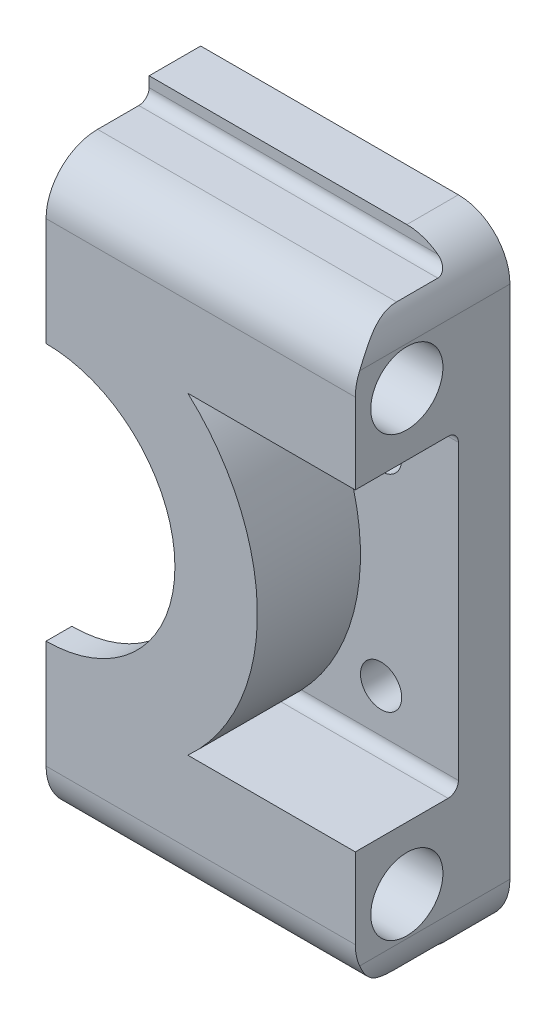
from build123d import *

# Parameters (mm, degrees)
SKETCH1_R           = 36
SKETCH1_R_2         = 4
BOSS_EXTRUDE1_DEPTH = 10
SKETCH2_R           = 41
SKETCH2_R_2         = 36
BOSS_EXTRUDE2_DEPTH = 15
SKETCH3_R           = 41
SKETCH3_R_2         = 25
BOSS_EXTRUDE3_DEPTH = 5
SKETCH4_W           = 50.573269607
SKETCH4_H           = 160
CUT_EXTRUDE1_DEPTH  = 564.819305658
BOSS_EXTRUDE4_DEPTH = 20
SKETCH8_R           = 7
CUT_EXTRUDE2_DEPTH  = 564.819305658
FILLET3_R           = 2
FILLET4_R           = 2
FILLET5_R           = 10


with BuildPart() as part:
    # Sketch1 → Boss-Extrude1 (new body)
    with BuildSketch(Plane.XY.offset(-354)):
        with BuildLine():
            Line((50, 434.713939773), (-50, 434.713939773))
            ThreePointArc((-50, 434.713939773), (-57.071067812, 431.785007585), (-60, 424.713939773))
            Line((-60, 424.713939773), (-60, 324.713939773))
            ThreePointArc((-60, 324.713939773), (-57.071067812, 317.642871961), (-50, 314.713939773))
            Line((-50, 314.713939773), (50, 314.713939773))
            ThreePointArc((50, 314.713939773), (57.071067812, 317.642871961), (60, 324.713939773))
            Line((60, 324.713939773), (60, 424.713939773))
            ThreePointArc((60, 424.713939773), (57.071067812, 431.785007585), (50, 434.713939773))
        make_face()
        with Locations((0, 374.713939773)):
            Circle(SKETCH1_R, mode=Mode.SUBTRACT)
        with Locations((45, 394.713939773)):
            Circle(SKETCH1_R_2, mode=Mode.SUBTRACT)
        with Locations((45, 354.713939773)):
            Circle(SKETCH1_R_2, mode=Mode.SUBTRACT)
    extrude(amount=BOSS_EXTRUDE1_DEPTH)

    # Sketch2 → Boss-Extrude2 (add)
    with BuildSketch(Plane.XY.offset(-344)):
        with Locations(Location((0, 374.713939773, 0), (0, 0, 180))):
            Circle(SKETCH2_R)
        with Locations((0, 374.713939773)):
            Circle(SKETCH2_R_2, mode=Mode.SUBTRACT)
    extrude(amount=BOSS_EXTRUDE2_DEPTH)

    # Sketch3 → Boss-Extrude3 (add)
    with BuildSketch(Plane.XY.offset(-329)):
        with Locations(Location((0, 374.713939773, 0), (0, 0, 180))):
            Circle(SKETCH3_R)
        with Locations((0, 374.713939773)):
            Circle(SKETCH3_R_2, mode=Mode.SUBTRACT)
    extrude(amount=BOSS_EXTRUDE3_DEPTH)

    # Sketch4 → Cut-Extrude1 (cut, through all)
    with BuildSketch(Plane.ZY):
        with Locations((-338.713365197, 363.916305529)):
            Rectangle(SKETCH4_W, SKETCH4_H)
    extrude(amount=CUT_EXTRUDE1_DEPTH, mode=Mode.SUBTRACT)

    # Sketch5 → Boss-Extrude4 (add)
    with BuildSketch(Plane.XY.offset(-344)):
        with BuildLine():
            Line((60, 405.123642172), (27.5, 405.123642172))
            ThreePointArc((27.5, 405.123642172), (14.734351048, 412.974871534), (0, 415.713939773))
            Line((0, 415.713939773), (0, 430.713939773))
            Line((0, 430.713939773), (58, 430.713939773))
            ThreePointArc((58, 430.713939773), (59.486832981, 427.876217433), (60, 424.713939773))
            Line((60, 424.713939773), (60, 405.123642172))
        make_face()
    boss_extrude4 = extrude(amount=BOSS_EXTRUDE4_DEPTH)

    # Sketch8 → Cut-Extrude2 (cut, through all)
    with BuildSketch(Plane(origin=(60, 0, 0), x_dir=(0, 0, -1), z_dir=(1, 0, 0))):
        with Locations(Location((334, 417.213939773, 0), (0, 0, 90))):
            Circle(SKETCH8_R)
    cut_extrude2 = extrude(amount=-CUT_EXTRUDE2_DEPTH, mode=Mode.SUBTRACT)

    # Fillet3
    fillet3_edges = [part.edges().sort_by_distance(p)[0] for p in [
        (43.75, 405.123642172, -344),
        (29, 430.713939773, -344),
    ]]
    fillet(fillet3_edges, radius=FILLET3_R)

    # Mirror4: Boss-Extrude4, Cut-Extrude2 across plane
    add(boss_extrude4.mirror(Plane.ZX.offset(374.713939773)))
    add(cut_extrude2.mirror(Plane.ZX.offset(374.713939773)), mode=Mode.SUBTRACT)

    # Fillet4
    fillet4_edges = [part.edges().sort_by_distance(p)[0] for p in [
        (43.75, 344.304237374, -344),
        (29, 318.713939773, -344),
    ]]
    fillet(fillet4_edges, radius=FILLET4_R)

    # Fillet5
    fillet5_edges = [part.edges().sort_by_distance(p)[0] for p in [
        (29, 318.713939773, -324),
        (29, 430.713939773, -324),
    ]]
    fillet(fillet5_edges, radius=FILLET5_R)


solid = part.part
